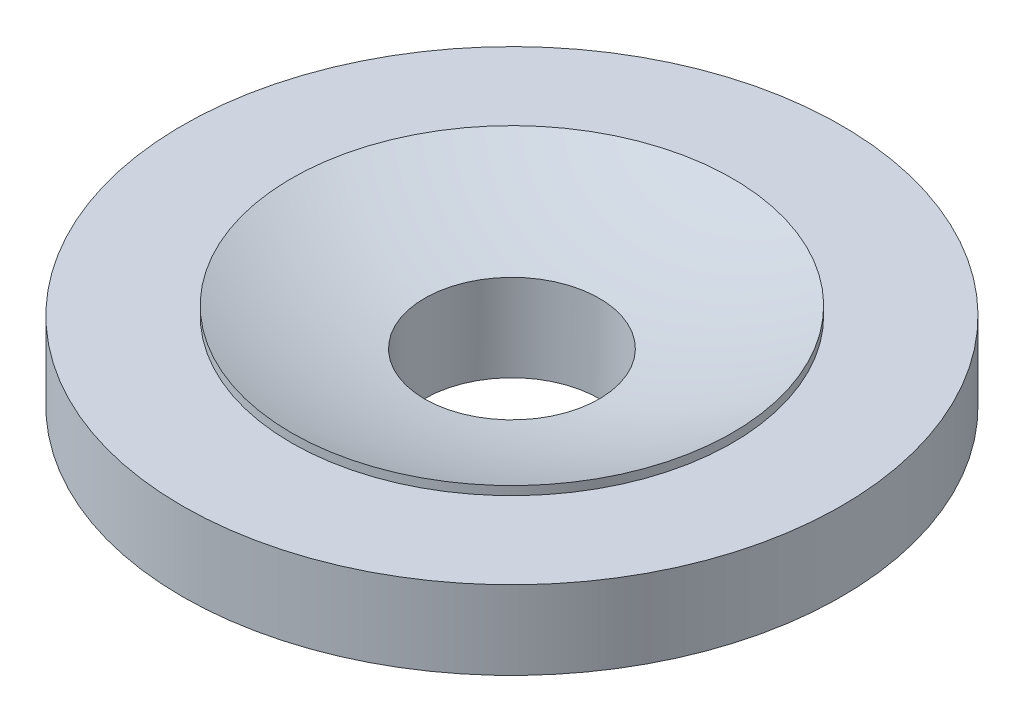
from build123d import *

# Parameters (mm, degrees)
CUT_EXTRUDE3_DEPTH      = 222.815238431
CUT_EXTRUDE3_DEPTH_BACK = 222.815238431
SKETCH9_R               = 40


with BuildPart() as part:
    # Sketch7 → Revolve4 (revolve)
    with BuildSketch(Plane.XY, mode=Mode.PRIVATE) as revolve4_sk:
        with BuildLine():
            Line((-101, 0), (-101, -4))
            Line((-101, -4), (-151, -4))
            Line((-151, -4), (-151, -39.988196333))
            Line((-151, -39.988196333), (-100.028324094, -39.988196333))
            ThreePointArc((-100.028324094, -39.988196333), (-51.005239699, -54.947966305), (0, -60))
            Line((0, -60), (0, -20))
            ThreePointArc((0, -20), (-51.49990945, -15.049542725), (-101, 0))
        make_face()
    revolve(revolve4_sk.sketch.rotate(Axis((0, 0, 0), (0, -1, 0)), 270), axis=Axis((0, 0, 0), (0, -1, 0)))

    # Sketch9 → Cut-Extrude3 (cut, two sides: drawn at the far end of the back side and taken through both)
    with BuildSketch(Plane(origin=(0, 0, 0), x_dir=(1, 0, 0), z_dir=(0, 1, 0)).offset(-CUT_EXTRUDE3_DEPTH_BACK)):
        with Locations(Location((0, 0, 0), (0, 0, 270))):
            Circle(SKETCH9_R)
    extrude(amount=CUT_EXTRUDE3_DEPTH + CUT_EXTRUDE3_DEPTH_BACK, mode=Mode.SUBTRACT)


solid = part.part
